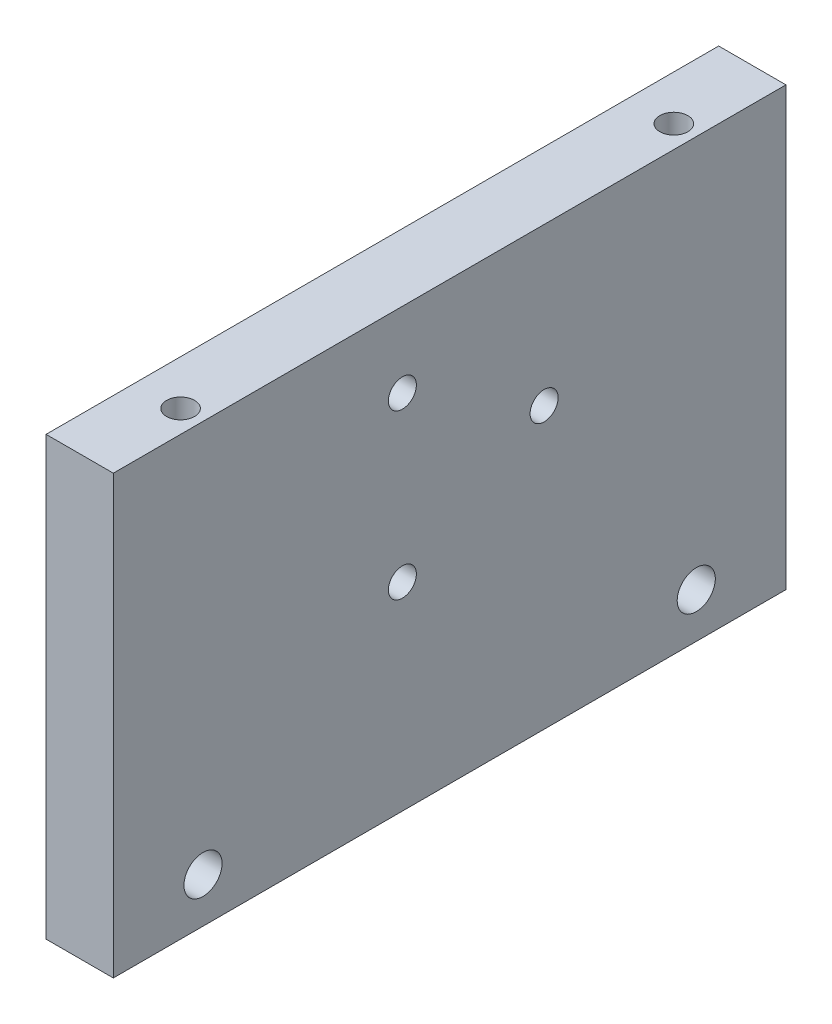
from build123d import *

# Parameters (mm, degrees)
SKETCH1_W                                       = 60
SKETCH1_H                                       = 39
BOSS_EXTRUDE1_DEPTH                             = 3
CSK_FOR_M3_FLAT_HEAD_MACHINE_SCREW1_D           = 3.4
CSK_FOR_M3_FLAT_HEAD_MACHINE_SCREW1_CSINK_D     = 6.3
CSK_FOR_M3_FLAT_HEAD_MACHINE_SCREW1_CSINK_ANGLE = 90
M3X0_5_TAPPED_HOLE1_D                           = 2.5
M3X0_5_TAPPED_HOLE1_DEPTH                       = 7.5
M3X0_5_TAPPED_HOLE1_TIP                         = 0.751075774
M3X0_5_TAPPED_HOLE2_D                           = 2.5


with BuildPart() as part:
    # Sketch1 → Boss-Extrude1 (new, symmetric)
    with BuildSketch(Plane(origin=(0, 0, 0), x_dir=(0, 0, -1), z_dir=(1, 0, 0))):
        Rectangle(SKETCH1_W, SKETCH1_H)
    extrude(amount=BOSS_EXTRUDE1_DEPTH, both=True)

    # CSK for M3 Flat Head Machine Screw1 (through all)
    with Locations(Plane.ZY.offset(3)):
        with Locations((-22, -15.5), (22, -15.5)):
            CounterSinkHole(CSK_FOR_M3_FLAT_HEAD_MACHINE_SCREW1_D / 2, CSK_FOR_M3_FLAT_HEAD_MACHINE_SCREW1_CSINK_D / 2, counter_sink_angle=CSK_FOR_M3_FLAT_HEAD_MACHINE_SCREW1_CSINK_ANGLE)

    # M3x0.5 Tapped Hole1
    with Locations(Plane(origin=(0, 19.5, 0), x_dir=(1, 0, 0), z_dir=(0, 1, 0))):
        with Locations((1, 22), (1, -22)):
            Hole(M3X0_5_TAPPED_HOLE1_D / 2, depth=M3X0_5_TAPPED_HOLE1_DEPTH)
            with Locations((0, 0, -(M3X0_5_TAPPED_HOLE1_DEPTH + M3X0_5_TAPPED_HOLE1_TIP / 2))):  # 118° drill point
                Cone(0, M3X0_5_TAPPED_HOLE1_D / 2, M3X0_5_TAPPED_HOLE1_TIP, mode=Mode.SUBTRACT)

    # M3x0.5 Tapped Hole2 (through all)
    with Locations(Plane.ZY.offset(3)):
        with Locations((-8.42931393, 5.5), (4.215212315, 12.800961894), (4.215212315, -1.800961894)):
            Hole(M3X0_5_TAPPED_HOLE2_D / 2)


solid = part.part
